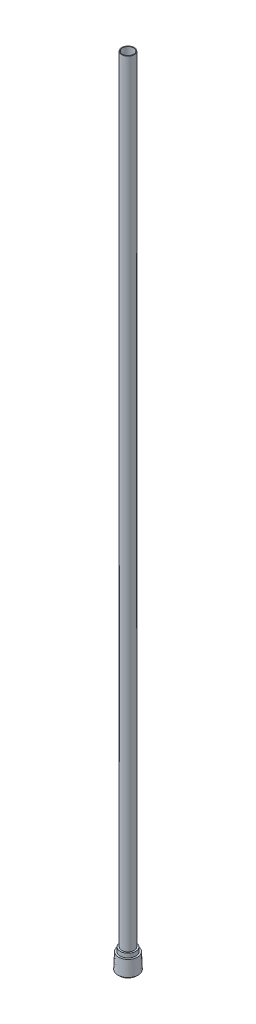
from build123d import *

# Parameters (mm, degrees)
CUT_EXTRUDE2_DEPTH = 3.9624
SKETCH2_R          = 2.1209
CUT_EXTRUDE1_DEPTH = 300.8376
CHAMFER1_SIZE      = 0.508
CHAMFER1_SIZE2     = 0.49045616


with BuildPart() as part:
    # Sketch1 → Revolve1 (revolve)
    with BuildSketch(Plane(origin=(0, 0, 0), x_dir=(0, 0, -1), z_dir=(1, 0, 0)), mode=Mode.PRIVATE) as revolve1_sk:
        Polygon((0, 304.8), (0, 0), (3.8989, 0), (3.667387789, 6.35), (2.9845, 6.35), (2.9845, 7.9248), (2.3749, 7.9248), (2.3749, 304.8), align=None)
    revolve(revolve1_sk.sketch.rotate(Axis((0, 0, 0), (0, -1, 0)), 180), axis=Axis((0, 0, 0), (0, -1, 0)))

    # Sketch3 → Cut-Extrude2 (cut)
    with BuildSketch(Plane(origin=(0, 0, 0), x_dir=(-1, 0, 0), z_dir=(0, -1, 0))):
        Polygon((0, -2.287692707), (1.9812, -1.143846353), (1.9812, 1.143846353), (0, 2.287692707), (-1.9812, 1.143846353), (-1.9812, -1.143846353), align=None)
    extrude(amount=-CUT_EXTRUDE2_DEPTH, mode=Mode.SUBTRACT)

    # Sketch2 → Cut-Extrude1 (cut)
    with BuildSketch(Plane(origin=(0, 304.8, 0), x_dir=(1, 0, 0), z_dir=(0, 1, 0))):
        with Locations(Location((0, 0, 0), (0, 0, 270))):
            Circle(SKETCH2_R)
    extrude(amount=-CUT_EXTRUDE1_DEPTH, mode=Mode.SUBTRACT)

    # Chamfer1
    chamfer1_edges = [part.edges().sort_by_distance(p)[0] for p in [
        (0, 0, -3.8989),
    ]]
    chamfer1_side = [part.faces().sort_by_distance(p)[0] for p in [
        (0, 0, -3.788622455),
    ]]
    chamfer(chamfer1_edges, length=CHAMFER1_SIZE, length2=CHAMFER1_SIZE2, reference=chamfer1_side[0])


solid = part.part
